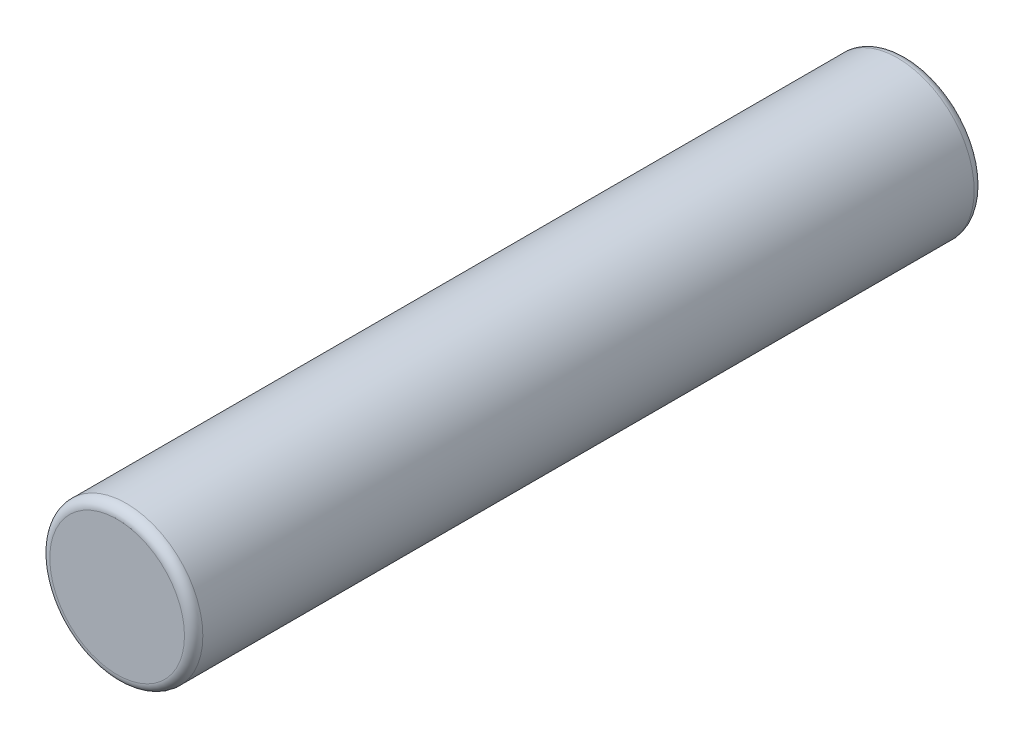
from build123d import *

# Parameters (mm, degrees)
ESQUISSE1_R      = 2.5
EXTRUSION1_DEPTH = 25.8
CONG_1_R         = 0.3


with BuildPart() as part:
    # Esquisse1 → Extrusion1 (new body)
    with BuildSketch(Plane.XY):
        with Locations(Location((0, 0, 0), (0, 0, 180))):
            Circle(ESQUISSE1_R)
    extrude(amount=EXTRUSION1_DEPTH)

    # Cong_1
    cong_1_edges = [part.edges().sort_by_distance(p)[0] for p in [
        (2.5, 0, 0),
        (2.5, 0, 25.8),
    ]]
    fillet(cong_1_edges, radius=CONG_1_R)


solid = part.part
